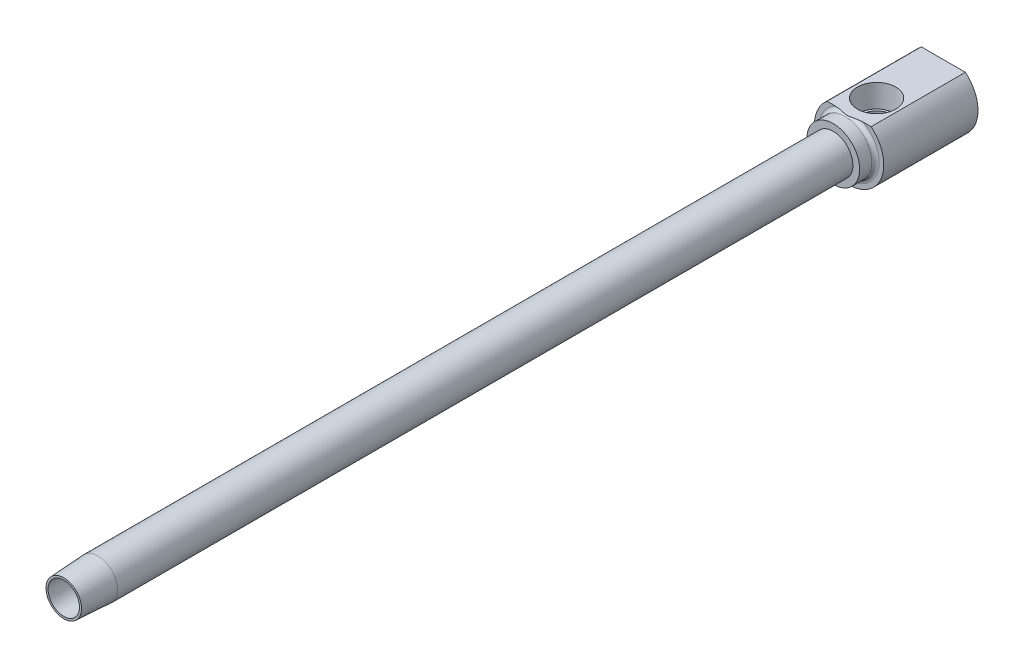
ISO-10303-21;
HEADER;
FILE_DESCRIPTION(('STEP AP214'),'2;1');
FILE_NAME('part.step','',(''),(''),'','','');
FILE_SCHEMA(('AUTOMOTIVE_DESIGN { 1 0 10303 214 1 1 1 1 }'));
ENDSEC;
DATA;
#1=APPLICATION_CONTEXT('core data for automotive mechanical design processes');
#2=APPLICATION_PROTOCOL_DEFINITION('international standard','automotive_design',2000,#1);
#3=PRODUCT_CONTEXT('',#1,'mechanical');
#4=PRODUCT('Part','Part','',(#3));
#5=PRODUCT_RELATED_PRODUCT_CATEGORY('part','',(#4));
#6=PRODUCT_DEFINITION_FORMATION('','',#4);
#7=PRODUCT_DEFINITION_CONTEXT('part definition',#1,'design');
#8=PRODUCT_DEFINITION('design','',#6,#7);
#9=PRODUCT_DEFINITION_SHAPE('','',#8);
#10=(LENGTH_UNIT() NAMED_UNIT(*) SI_UNIT(.MILLI.,.METRE.));
#11=(NAMED_UNIT(*) PLANE_ANGLE_UNIT() SI_UNIT($,.RADIAN.));
#12=(NAMED_UNIT(*) SI_UNIT($,.STERADIAN.) SOLID_ANGLE_UNIT());
#13=UNCERTAINTY_MEASURE_WITH_UNIT(LENGTH_MEASURE(1.E-05),#10,'distance_accuracy_value','');
#14=(GEOMETRIC_REPRESENTATION_CONTEXT(3) GLOBAL_UNCERTAINTY_ASSIGNED_CONTEXT((#13)) GLOBAL_UNIT_ASSIGNED_CONTEXT((#10,
#11,#12)) REPRESENTATION_CONTEXT('',''));
#15=CARTESIAN_POINT('',(0.,0.,0.));
#16=DIRECTION('',(0.,0.,1.));
#17=DIRECTION('',(1.,0.,0.));
#18=AXIS2_PLACEMENT_3D('',#15,#16,#17);
#19=CARTESIAN_POINT('',(0.,0.,-223.634766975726));
#20=DIRECTION('',(0.,0.,-1.));
#21=DIRECTION('',(-1.,0.,0.));
#22=AXIS2_PLACEMENT_3D('',#19,#20,#21);
#23=CYLINDRICAL_SURFACE('',#22,3.9751);
#24=CARTESIAN_POINT('',(0.,0.,-6.8834));
#25=DIRECTION('',(0.,0.,-1.));
#26=DIRECTION('',(-1.,0.,0.));
#27=AXIS2_PLACEMENT_3D('',#24,#25,#26);
#28=CIRCLE('',#27,3.9751);
#29=CARTESIAN_POINT('',(-3.9751,0.,-6.8834));
#30=VERTEX_POINT('',#29);
#31=EDGE_CURVE('E230',#30,#30,#28,.T.);
#32=ORIENTED_EDGE('',*,*,#31,.T.);
#33=EDGE_LOOP('',(#32));
#34=FACE_BOUND('',#33,.T.);
#35=CARTESIAN_POINT('',(0.,0.,-155.5496));
#36=DIRECTION('',(0.,0.,-1.));
#37=DIRECTION('',(-1.,0.,0.));
#38=AXIS2_PLACEMENT_3D('',#35,#36,#37);
#39=CIRCLE('',#38,3.9751);
#40=CARTESIAN_POINT('',(-3.9751,0.,-155.5496));
#41=VERTEX_POINT('',#40);
#42=EDGE_CURVE('E190',#41,#41,#39,.T.);
#43=ORIENTED_EDGE('',*,*,#42,.F.);
#44=EDGE_LOOP('',(#43));
#45=FACE_BOUND('',#44,.T.);
#46=ADVANCED_FACE('F15',(#34,#45),#23,.T.);
#47=CARTESIAN_POINT('',(-3.175,0.,-155.5496));
#48=DIRECTION('',(0.,0.,1.));
#49=DIRECTION('',(1.,0.,0.));
#50=AXIS2_PLACEMENT_3D('',#47,#48,#49);
#51=PLANE('',#50);
#52=CARTESIAN_POINT('',(0.,0.,-155.5496));
#53=DIRECTION('',(0.,0.,-1.));
#54=DIRECTION('',(-1.,0.,0.));
#55=AXIS2_PLACEMENT_3D('',#52,#53,#54);
#56=CIRCLE('',#55,3.175);
#57=CARTESIAN_POINT('',(-3.175,0.,-155.5496));
#58=VERTEX_POINT('',#57);
#59=EDGE_CURVE('E234',#58,#58,#56,.T.);
#60=ORIENTED_EDGE('',*,*,#59,.F.);
#61=EDGE_LOOP('',(#60));
#62=FACE_BOUND('',#61,.T.);
#63=CARTESIAN_POINT('',(0.,-0.206790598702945,-155.5496));
#64=DIRECTION('',(0.,0.,1.));
#65=DIRECTION('',(0.,1.,0.));
#66=AXIS2_PLACEMENT_3D('',#63,#64,#65);
#67=ELLIPSE('',#66,2.91070678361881,2.77750646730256);
#68=CARTESIAN_POINT('',(0.,2.70391618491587,-155.5496));
#69=VERTEX_POINT('',#68);
#70=EDGE_CURVE('E192',#69,#69,#67,.F.);
#71=ORIENTED_EDGE('',*,*,#70,.T.);
#72=EDGE_LOOP('',(#71));
#73=FACE_BOUND('',#72,.T.);
#74=ADVANCED_FACE('F211',(#62,#73),#51,.T.);
#75=CARTESIAN_POINT('',(-3.9751,0.,-155.5496));
#76=DIRECTION('',(0.,0.,1.));
#77=DIRECTION('',(1.,0.,0.));
#78=AXIS2_PLACEMENT_3D('',#75,#76,#77);
#79=PLANE('',#78);
#80=ORIENTED_EDGE('',*,*,#42,.T.);
#81=EDGE_LOOP('',(#80));
#82=FACE_BOUND('',#81,.T.);
#83=CARTESIAN_POINT('',(0.,0.,-155.5496));
#84=DIRECTION('',(0.,0.,-1.));
#85=DIRECTION('',(-1.,0.,0.));
#86=AXIS2_PLACEMENT_3D('',#83,#84,#85);
#87=CIRCLE('',#86,5.334);
#88=CARTESIAN_POINT('',(-5.334,0.,-155.5496));
#89=VERTEX_POINT('',#88);
#90=EDGE_CURVE('E252',#89,#89,#87,.T.);
#91=ORIENTED_EDGE('',*,*,#90,.F.);
#92=EDGE_LOOP('',(#91));
#93=FACE_BOUND('',#92,.T.);
#94=ADVANCED_FACE('F214',(#82,#93),#79,.T.);
#95=CARTESIAN_POINT('',(-3.175,0.,0.));
#96=DIRECTION('',(0.,0.,1.));
#97=DIRECTION('',(1.,0.,0.));
#98=AXIS2_PLACEMENT_3D('',#95,#96,#97);
#99=PLANE('',#98);
#100=CARTESIAN_POINT('',(0.,0.,0.));
#101=DIRECTION('',(0.,0.,-1.));
#102=DIRECTION('',(-1.,0.,0.));
#103=AXIS2_PLACEMENT_3D('',#100,#101,#102);
#104=CIRCLE('',#103,3.5941);
#105=CARTESIAN_POINT('',(-3.5941,0.,0.));
#106=VERTEX_POINT('',#105);
#107=EDGE_CURVE('E508',#106,#106,#104,.T.);
#108=ORIENTED_EDGE('',*,*,#107,.F.);
#109=EDGE_LOOP('',(#108));
#110=FACE_BOUND('',#109,.T.);
#111=CARTESIAN_POINT('',(0.,0.,0.));
#112=DIRECTION('',(0.,0.,-1.));
#113=DIRECTION('',(-1.,0.,0.));
#114=AXIS2_PLACEMENT_3D('',#111,#112,#113);
#115=CIRCLE('',#114,3.175);
#116=CARTESIAN_POINT('',(-3.175,0.,0.));
#117=VERTEX_POINT('',#116);
#118=EDGE_CURVE('E19',#117,#117,#115,.T.);
#119=ORIENTED_EDGE('',*,*,#118,.T.);
#120=EDGE_LOOP('',(#119));
#121=FACE_BOUND('',#120,.T.);
#122=ADVANCED_FACE('F17',(#110,#121),#99,.T.);
#123=CARTESIAN_POINT('',(0.,0.,-223.634766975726));
#124=DIRECTION('',(0.,0.,-1.));
#125=DIRECTION('',(-1.,0.,0.));
#126=AXIS2_PLACEMENT_3D('',#123,#124,#125);
#127=CYLINDRICAL_SURFACE('',#126,3.175);
#128=ORIENTED_EDGE('',*,*,#59,.T.);
#129=EDGE_LOOP('',(#128));
#130=FACE_BOUND('',#129,.T.);
#131=ORIENTED_EDGE('',*,*,#118,.F.);
#132=EDGE_LOOP('',(#131));
#133=FACE_BOUND('',#132,.T.);
#134=ADVANCED_FACE('F209',(#130,#133),#127,.F.);
#135=CARTESIAN_POINT('',(-7.0104,0.,-177.8));
#136=DIRECTION('',(0.,0.,-1.));
#137=DIRECTION('',(-1.,0.,0.));
#138=AXIS2_PLACEMENT_3D('',#135,#136,#137);
#139=PLANE('',#138);
#140=DIRECTION('',(1.,0.,0.));
#141=VECTOR('',#140,1.);
#142=CARTESIAN_POINT('',(-1.83308710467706,3.175,-177.8));
#143=LINE('',#142,#141);
#144=CARTESIAN_POINT('',(-1.83308710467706,3.175,-177.8));
#145=VERTEX_POINT('',#144);
#146=CARTESIAN_POINT('',(1.83308710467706,3.175,-177.8));
#147=VERTEX_POINT('',#146);
#148=EDGE_CURVE('E37',#145,#147,#143,.T.);
#149=ORIENTED_EDGE('',*,*,#148,.F.);
#150=DIRECTION('',(0.5,0.866025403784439,0.));
#151=VECTOR('',#150,1.);
#152=CARTESIAN_POINT('',(-3.66617420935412,0.,-177.8));
#153=LINE('',#152,#151);
#154=CARTESIAN_POINT('',(-3.66617420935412,0.,-177.8));
#155=VERTEX_POINT('',#154);
#156=EDGE_CURVE('E278',#155,#145,#153,.T.);
#157=ORIENTED_EDGE('',*,*,#156,.F.);
#158=DIRECTION('',(-0.5,0.866025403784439,0.));
#159=VECTOR('',#158,1.);
#160=CARTESIAN_POINT('',(-1.83308710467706,-3.175,-177.8));
#161=LINE('',#160,#159);
#162=CARTESIAN_POINT('',(-1.83308710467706,-3.175,-177.8));
#163=VERTEX_POINT('',#162);
#164=EDGE_CURVE('E282',#163,#155,#161,.T.);
#165=ORIENTED_EDGE('',*,*,#164,.F.);
#166=DIRECTION('',(-1.,0.,0.));
#167=VECTOR('',#166,1.);
#168=CARTESIAN_POINT('',(1.83308710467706,-3.175,-177.8));
#169=LINE('',#168,#167);
#170=CARTESIAN_POINT('',(1.83308710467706,-3.175,-177.8));
#171=VERTEX_POINT('',#170);
#172=EDGE_CURVE('E285',#171,#163,#169,.T.);
#173=ORIENTED_EDGE('',*,*,#172,.F.);
#174=DIRECTION('',(-0.5,-0.866025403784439,0.));
#175=VECTOR('',#174,1.);
#176=CARTESIAN_POINT('',(3.66617420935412,0.,-177.8));
#177=LINE('',#176,#175);
#178=CARTESIAN_POINT('',(3.66617420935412,0.,-177.8));
#179=VERTEX_POINT('',#178);
#180=EDGE_CURVE('E288',#179,#171,#177,.T.);
#181=ORIENTED_EDGE('',*,*,#180,.F.);
#182=DIRECTION('',(0.5,-0.866025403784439,0.));
#183=VECTOR('',#182,1.);
#184=CARTESIAN_POINT('',(1.83308710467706,3.175,-177.8));
#185=LINE('',#184,#183);
#186=EDGE_CURVE('E291',#147,#179,#185,.T.);
#187=ORIENTED_EDGE('',*,*,#186,.F.);
#188=EDGE_LOOP('',(#149,#157,#165,#173,#181,#187));
#189=FACE_BOUND('',#188,.T.);
#190=DIRECTION('',(-1.,0.,0.));
#191=VECTOR('',#190,1.);
#192=CARTESIAN_POINT('',(-4.4577,5.41060244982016,-177.8));
#193=LINE('',#192,#191);
#194=CARTESIAN_POINT('',(4.4577,5.41060244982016,-177.8));
#195=VERTEX_POINT('',#194);
#196=CARTESIAN_POINT('',(-4.4577,5.41060244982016,-177.8));
#197=VERTEX_POINT('',#196);
#198=EDGE_CURVE('E261',#195,#197,#193,.T.);
#199=ORIENTED_EDGE('',*,*,#198,.F.);
#200=CARTESIAN_POINT('',(0.,0.,-177.8));
#201=DIRECTION('',(0.,0.,-1.));
#202=DIRECTION('',(-1.,0.,0.));
#203=AXIS2_PLACEMENT_3D('',#200,#201,#202);
#204=CIRCLE('',#203,7.0104);
#205=EDGE_CURVE('E238',#195,#197,#204,.T.);
#206=ORIENTED_EDGE('',*,*,#205,.T.);
#207=EDGE_LOOP('',(#199,#206));
#208=FACE_BOUND('',#207,.T.);
#209=ADVANCED_FACE('F205',(#189,#208),#139,.T.);
#210=CARTESIAN_POINT('',(0.,0.,-223.634766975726));
#211=DIRECTION('',(0.,0.,-1.));
#212=DIRECTION('',(-1.,0.,0.));
#213=AXIS2_PLACEMENT_3D('',#210,#211,#212);
#214=CYLINDRICAL_SURFACE('',#213,7.0104);
#215=DIRECTION('',(0.,0.,-1.));
#216=VECTOR('',#215,1.);
#217=CARTESIAN_POINT('',(-4.4577,5.41060244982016,-148.4376));
#218=LINE('',#217,#216);
#219=CARTESIAN_POINT('',(-4.4577,5.41060244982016,-158.75));
#220=VERTEX_POINT('',#219);
#221=EDGE_CURVE('E258',#220,#197,#218,.T.);
#222=ORIENTED_EDGE('',*,*,#221,.T.);
#223=ORIENTED_EDGE('',*,*,#205,.F.);
#224=DIRECTION('',(0.,0.,-1.));
#225=VECTOR('',#224,1.);
#226=CARTESIAN_POINT('',(4.4577,5.41060244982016,-148.4376));
#227=LINE('',#226,#225);
#228=CARTESIAN_POINT('',(4.4577,5.41060244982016,-158.75));
#229=VERTEX_POINT('',#228);
#230=EDGE_CURVE('E259',#229,#195,#227,.T.);
#231=ORIENTED_EDGE('',*,*,#230,.F.);
#232=CARTESIAN_POINT('',(0.,0.,-158.75));
#233=DIRECTION('',(0.,0.,-1.));
#234=DIRECTION('',(-1.,0.,0.));
#235=AXIS2_PLACEMENT_3D('',#232,#233,#234);
#236=CIRCLE('',#235,7.0104);
#237=EDGE_CURVE('E241',#229,#220,#236,.T.);
#238=ORIENTED_EDGE('',*,*,#237,.T.);
#239=EDGE_LOOP('',(#222,#223,#231,#238));
#240=FACE_BOUND('',#239,.T.);
#241=ADVANCED_FACE('F201',(#240),#214,.T.);
#242=CARTESIAN_POINT('',(-6.096,0.,-158.75));
#243=DIRECTION('',(0.,0.,1.));
#244=DIRECTION('',(1.,0.,0.));
#245=AXIS2_PLACEMENT_3D('',#242,#243,#244);
#246=PLANE('',#245);
#247=DIRECTION('',(1.,0.,0.));
#248=VECTOR('',#247,1.);
#249=CARTESIAN_POINT('',(-6.096,5.41060244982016,-158.75));
#250=LINE('',#249,#248);
#251=CARTESIAN_POINT('',(-2.80830858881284,5.41060244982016,-158.75));
#252=VERTEX_POINT('',#251);
#253=EDGE_CURVE('E255',#220,#252,#250,.T.);
#254=ORIENTED_EDGE('',*,*,#253,.F.);
#255=ORIENTED_EDGE('',*,*,#237,.F.);
#256=CARTESIAN_POINT('',(2.80830858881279,5.41060244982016,-158.75));
#257=VERTEX_POINT('',#256);
#258=EDGE_CURVE('E256',#257,#229,#250,.T.);
#259=ORIENTED_EDGE('',*,*,#258,.F.);
#260=CARTESIAN_POINT('',(0.,0.,-158.75));
#261=DIRECTION('',(0.,0.,-1.));
#262=DIRECTION('',(-1.,0.,0.));
#263=AXIS2_PLACEMENT_3D('',#260,#261,#262);
#264=CIRCLE('',#263,6.096);
#265=EDGE_CURVE('E246',#257,#252,#264,.T.);
#266=ORIENTED_EDGE('',*,*,#265,.T.);
#267=EDGE_LOOP('',(#254,#255,#259,#266));
#268=FACE_BOUND('',#267,.T.);
#269=ADVANCED_FACE('F197',(#268),#246,.T.);
#270=CARTESIAN_POINT('',(0.,0.,-157.988));
#271=DIRECTION('',(0.,0.,-1.));
#272=DIRECTION('',(-1.,0.,0.));
#273=AXIS2_PLACEMENT_3D('',#270,#271,#272);
#274=TOROIDAL_SURFACE('',#273,6.096,0.762);
#275=CARTESIAN_POINT('',(0.,5.41060244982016,-158.320977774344));
#276=CARTESIAN_POINT('',(0.0521470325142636,5.41060244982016,-158.320966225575));
#277=CARTESIAN_POINT('',(0.104287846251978,5.41060244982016,-158.322542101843));
#278=CARTESIAN_POINT('',(0.208401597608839,5.41060244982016,-158.328631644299));
#279=CARTESIAN_POINT('',(0.260374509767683,5.41060244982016,-158.333145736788));
#280=CARTESIAN_POINT('',(0.416241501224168,5.41060244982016,-158.350448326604));
#281=CARTESIAN_POINT('',(0.519704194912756,5.41060244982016,-158.366991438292));
#282=CARTESIAN_POINT('',(0.726918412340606,5.41060244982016,-158.405619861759));
#283=CARTESIAN_POINT('',(0.830655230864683,5.41060244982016,-158.427776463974));
#284=CARTESIAN_POINT('',(1.03759009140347,5.41060244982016,-158.473840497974));
#285=CARTESIAN_POINT('',(1.14078865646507,5.41060244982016,-158.497745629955));
#286=CARTESIAN_POINT('',(1.34834228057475,5.41060244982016,-158.545205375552));
#287=CARTESIAN_POINT('',(1.45269869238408,5.41060244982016,-158.568754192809));
#288=CARTESIAN_POINT('',(1.66197970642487,5.41060244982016,-158.613460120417));
#289=CARTESIAN_POINT('',(1.76690452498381,5.41060244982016,-158.634616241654));
#290=CARTESIAN_POINT('',(1.97693672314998,5.41060244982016,-158.672852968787));
#291=CARTESIAN_POINT('',(2.0820400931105,5.41060244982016,-158.689954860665));
#292=CARTESIAN_POINT('',(2.2929864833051,5.41060244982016,-158.718645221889));
#293=CARTESIAN_POINT('',(2.39882937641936,5.41060244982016,-158.730234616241));
#294=CARTESIAN_POINT('',(2.63825679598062,5.41060244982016,-158.748170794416));
#295=CARTESIAN_POINT('',(2.77203238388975,5.41060244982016,-158.752426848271));
#296=CARTESIAN_POINT('',(2.97236053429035,5.41060244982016,-158.74675427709));
#297=CARTESIAN_POINT('',(3.03908464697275,5.41060244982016,-158.74285339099));
#298=CARTESIAN_POINT('',(3.17206397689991,5.41060244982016,-158.730250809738));
#299=CARTESIAN_POINT('',(3.23831943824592,5.41060244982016,-158.721551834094));
#300=CARTESIAN_POINT('',(3.37725624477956,5.41060244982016,-158.69711512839));
#301=CARTESIAN_POINT('',(3.44982215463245,5.41060244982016,-158.68069575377));
#302=CARTESIAN_POINT('',(3.5924596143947,5.41060244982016,-158.639071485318));
#303=CARTESIAN_POINT('',(3.66253326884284,5.41060244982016,-158.613874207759));
#304=CARTESIAN_POINT('',(3.77900159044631,5.41060244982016,-158.561023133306));
#305=CARTESIAN_POINT('',(3.82657256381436,5.41060244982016,-158.535989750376));
#306=CARTESIAN_POINT('',(3.91754959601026,5.41060244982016,-158.479184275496));
#307=CARTESIAN_POINT('',(3.96096325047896,5.41060244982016,-158.447424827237));
#308=CARTESIAN_POINT('',(4.02798010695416,5.41060244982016,-158.38789070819));
#309=CARTESIAN_POINT('',(4.05342428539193,5.41060244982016,-158.362198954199));
#310=CARTESIAN_POINT('',(4.10009948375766,5.41060244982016,-158.307215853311));
#311=CARTESIAN_POINT('',(4.12133630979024,5.41060244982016,-158.277929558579));
#312=CARTESIAN_POINT('',(4.15466127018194,5.41060244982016,-158.22188761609));
#313=CARTESIAN_POINT('',(4.1677217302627,5.41060244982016,-158.195714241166));
#314=CARTESIAN_POINT('',(4.18933719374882,5.41060244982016,-158.141556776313));
#315=CARTESIAN_POINT('',(4.19789541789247,5.41060244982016,-158.113573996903));
#316=CARTESIAN_POINT('',(4.20987180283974,5.41060244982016,-158.056334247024));
#317=CARTESIAN_POINT('',(4.21325884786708,5.41060244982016,-158.027070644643));
#318=CARTESIAN_POINT('',(4.21447858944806,5.41060244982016,-157.968428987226));
#319=CARTESIAN_POINT('',(4.2123124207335,5.41060244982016,-157.939050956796));
#320=CARTESIAN_POINT('',(4.20309810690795,5.41060244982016,-157.883964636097));
#321=CARTESIAN_POINT('',(4.19653350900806,5.41060244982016,-157.858172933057));
#322=CARTESIAN_POINT('',(4.17948851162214,5.41060244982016,-157.807930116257));
#323=CARTESIAN_POINT('',(4.16900680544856,5.41060244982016,-157.783479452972));
#324=CARTESIAN_POINT('',(4.14035818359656,5.41060244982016,-157.727852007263));
#325=CARTESIAN_POINT('',(4.1207833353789,5.41060244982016,-157.69740126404));
#326=CARTESIAN_POINT('',(4.07697861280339,5.41060244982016,-157.640060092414));
#327=CARTESIAN_POINT('',(4.05273917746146,5.41060244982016,-157.613177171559));
#328=CARTESIAN_POINT('',(3.98868725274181,5.41060244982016,-157.551156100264));
#329=CARTESIAN_POINT('',(3.94690497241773,5.41060244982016,-157.518064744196));
#330=CARTESIAN_POINT('',(3.85879527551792,5.41060244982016,-157.458693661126));
#331=CARTESIAN_POINT('',(3.81245915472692,5.41060244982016,-157.432427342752));
#332=CARTESIAN_POINT('',(3.72452671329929,5.41060244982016,-157.389445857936));
#333=CARTESIAN_POINT('',(3.68333828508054,5.41060244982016,-157.371877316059));
#334=CARTESIAN_POINT('',(3.59958587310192,5.41060244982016,-157.340360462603));
#335=CARTESIAN_POINT('',(3.55702092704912,5.41060244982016,-157.326414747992));
#336=CARTESIAN_POINT('',(3.42786902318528,5.41060244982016,-157.289290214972));
#337=CARTESIAN_POINT('',(3.33991210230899,5.41060244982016,-157.270863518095));
#338=CARTESIAN_POINT('',(3.16528158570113,5.41060244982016,-157.244240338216));
#339=CARTESIAN_POINT('',(3.07864723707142,5.41060244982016,-157.235756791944));
#340=CARTESIAN_POINT('',(2.90489485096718,5.41060244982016,-157.226131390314));
#341=CARTESIAN_POINT('',(2.8177763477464,5.41060244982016,-157.224998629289));
#342=CARTESIAN_POINT('',(2.64327811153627,5.41060244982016,-157.22865046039));
#343=CARTESIAN_POINT('',(2.55589913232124,5.41060244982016,-157.233463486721));
#344=CARTESIAN_POINT('',(2.38166962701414,5.41060244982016,-157.247864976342));
#345=CARTESIAN_POINT('',(2.29481855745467,5.41060244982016,-157.257447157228));
#346=CARTESIAN_POINT('',(2.01384766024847,5.41060244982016,-157.294670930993));
#347=CARTESIAN_POINT('',(1.82076533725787,5.41060244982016,-157.329945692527));
#348=CARTESIAN_POINT('',(1.53229430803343,5.41060244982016,-157.389884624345));
#349=CARTESIAN_POINT('',(1.43609183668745,5.41060244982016,-157.411096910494));
#350=CARTESIAN_POINT('',(1.24390982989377,5.41060244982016,-157.454534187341));
#351=CARTESIAN_POINT('',(1.14793028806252,5.41060244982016,-157.476759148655));
#352=CARTESIAN_POINT('',(0.957697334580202,5.41060244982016,-157.520093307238));
#353=CARTESIAN_POINT('',(0.863446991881,5.41060244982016,-157.541215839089));
#354=CARTESIAN_POINT('',(0.674290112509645,5.41060244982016,-157.580544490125));
#355=CARTESIAN_POINT('',(0.57938341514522,5.41060244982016,-157.598749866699));
#356=CARTESIAN_POINT('',(0.389272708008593,5.41060244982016,-157.628753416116));
#357=CARTESIAN_POINT('',(0.294077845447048,5.41060244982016,-157.640603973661));
#358=CARTESIAN_POINT('',(0.150791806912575,5.41060244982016,-157.651139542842));
#359=CARTESIAN_POINT('',(0.102969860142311,5.41060244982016,-157.653445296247));
#360=CARTESIAN_POINT('',(0.00727423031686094,5.41060244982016,-157.6554444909));
#361=CARTESIAN_POINT('',(-0.0405994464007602,5.41060244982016,-157.655138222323));
#362=CARTESIAN_POINT('',(-0.136934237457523,5.41060244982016,-157.651917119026));
#363=CARTESIAN_POINT('',(-0.18539408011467,5.41060244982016,-157.648965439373));
#364=CARTESIAN_POINT('',(-0.282118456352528,5.41060244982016,-157.640689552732));
#365=CARTESIAN_POINT('',(-0.330382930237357,5.41060244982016,-157.635364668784));
#366=CARTESIAN_POINT('',(-0.475151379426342,5.41060244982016,-157.616449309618));
#367=CARTESIAN_POINT('',(-0.571263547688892,5.41060244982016,-157.599936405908));
#368=CARTESIAN_POINT('',(-0.764047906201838,5.41060244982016,-157.562565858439));
#369=CARTESIAN_POINT('',(-0.860707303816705,5.41060244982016,-157.541647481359));
#370=CARTESIAN_POINT('',(-1.05357295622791,5.41060244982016,-157.498459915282));
#371=CARTESIAN_POINT('',(-1.1497796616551,5.41060244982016,-157.476192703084));
#372=CARTESIAN_POINT('',(-1.36433899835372,5.41060244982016,-157.427144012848));
#373=CARTESIAN_POINT('',(-1.48272280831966,5.41060244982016,-157.400495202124));
#374=CARTESIAN_POINT('',(-1.72029970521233,5.41060244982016,-157.350573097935));
#375=CARTESIAN_POINT('',(-1.83949323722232,5.41060244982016,-157.327301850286));
#376=CARTESIAN_POINT('',(-2.07789765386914,5.41060244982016,-157.286591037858));
#377=CARTESIAN_POINT('',(-2.1971003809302,5.41060244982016,-157.269105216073));
#378=CARTESIAN_POINT('',(-2.43636519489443,5.41060244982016,-157.242063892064));
#379=CARTESIAN_POINT('',(-2.5564264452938,5.41060244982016,-157.232501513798));
#380=CARTESIAN_POINT('',(-2.76780194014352,5.41060244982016,-157.22516409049));
#381=CARTESIAN_POINT('',(-2.85902659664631,5.41060244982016,-157.225092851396));
#382=CARTESIAN_POINT('',(-3.04144991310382,5.41060244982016,-157.232751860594));
#383=CARTESIAN_POINT('',(-3.13264774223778,5.41060244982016,-157.240504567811));
#384=CARTESIAN_POINT('',(-3.31458996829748,5.41060244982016,-157.266086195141));
#385=CARTESIAN_POINT('',(-3.40532344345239,5.41060244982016,-157.284002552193));
#386=CARTESIAN_POINT('',(-3.53857286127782,5.41060244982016,-157.320698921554));
#387=CARTESIAN_POINT('',(-3.58245316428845,5.41060244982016,-157.334541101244));
#388=CARTESIAN_POINT('',(-3.66883050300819,5.41060244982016,-157.365985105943));
#389=CARTESIAN_POINT('',(-3.71132868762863,5.41060244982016,-157.383583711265));
#390=CARTESIAN_POINT('',(-3.7923438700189,5.41060244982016,-157.422178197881));
#391=CARTESIAN_POINT('',(-3.83095410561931,5.41060244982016,-157.442975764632));
#392=CARTESIAN_POINT('',(-3.9054933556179,5.41060244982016,-157.489081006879));
#393=CARTESIAN_POINT('',(-3.94141935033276,5.41060244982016,-157.514393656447));
#394=CARTESIAN_POINT('',(-4.00964525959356,5.41060244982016,-157.570392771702));
#395=CARTESIAN_POINT('',(-4.04189445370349,5.41060244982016,-157.601142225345));
#396=CARTESIAN_POINT('',(-4.10014383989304,5.41060244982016,-157.668084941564));
#397=CARTESIAN_POINT('',(-4.12616464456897,5.41060244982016,-157.704259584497));
#398=CARTESIAN_POINT('',(-4.16162371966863,5.41060244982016,-157.767760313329));
#399=CARTESIAN_POINT('',(-4.17366550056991,5.41060244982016,-157.793633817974));
#400=CARTESIAN_POINT('',(-4.19334521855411,5.41060244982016,-157.847014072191));
#401=CARTESIAN_POINT('',(-4.20098675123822,5.41060244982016,-157.874519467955));
#402=CARTESIAN_POINT('',(-4.21130602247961,5.41060244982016,-157.93060948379));
#403=CARTESIAN_POINT('',(-4.21395773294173,5.41060244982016,-157.959198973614));
#404=CARTESIAN_POINT('',(-4.21398264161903,5.41060244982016,-158.016380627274));
#405=CARTESIAN_POINT('',(-4.21135613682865,5.41060244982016,-158.044972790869));
#406=CARTESIAN_POINT('',(-4.2014381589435,5.41060244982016,-158.099159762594));
#407=CARTESIAN_POINT('',(-4.19450087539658,5.41060244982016,-158.124821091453));
#408=CARTESIAN_POINT('',(-4.1767694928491,5.41060244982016,-158.174761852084));
#409=CARTESIAN_POINT('',(-4.16597399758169,5.41060244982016,-158.199040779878));
#410=CARTESIAN_POINT('',(-4.13643456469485,5.41060244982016,-158.254664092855));
#411=CARTESIAN_POINT('',(-4.11622825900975,5.41060244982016,-158.28523117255));
#412=CARTESIAN_POINT('',(-4.07115731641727,5.41060244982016,-158.342709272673));
#413=CARTESIAN_POINT('',(-4.04628281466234,5.41060244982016,-158.369612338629));
#414=CARTESIAN_POINT('',(-3.98047143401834,5.41060244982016,-158.431796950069));
#415=CARTESIAN_POINT('',(-3.93753463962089,5.41060244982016,-158.464948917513));
#416=CARTESIAN_POINT('',(-3.84713170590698,5.41060244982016,-158.524276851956));
#417=CARTESIAN_POINT('',(-3.79965701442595,5.41060244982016,-158.550439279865));
#418=CARTESIAN_POINT('',(-3.7094552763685,5.41060244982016,-158.593219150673));
#419=CARTESIAN_POINT('',(-3.66712202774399,5.41060244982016,-158.610685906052));
#420=CARTESIAN_POINT('',(-3.5810935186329,5.41060244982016,-158.641903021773));
#421=CARTESIAN_POINT('',(-3.53739729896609,5.41060244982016,-158.655650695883));
#422=CARTESIAN_POINT('',(-3.40486938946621,5.41060244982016,-158.692069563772));
#423=CARTESIAN_POINT('',(-3.31469658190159,5.41060244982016,-158.709873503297));
#424=CARTESIAN_POINT('',(-3.13512177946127,5.41060244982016,-158.735172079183));
#425=CARTESIAN_POINT('',(-3.04574747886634,5.41060244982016,-158.742887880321));
#426=CARTESIAN_POINT('',(-2.86659161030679,5.41060244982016,-158.750757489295));
#427=CARTESIAN_POINT('',(-2.77680968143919,5.41060244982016,-158.750902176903));
#428=CARTESIAN_POINT('',(-2.59707026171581,5.41060244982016,-158.745129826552));
#429=CARTESIAN_POINT('',(-2.50711380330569,5.41060244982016,-158.739185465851));
#430=CARTESIAN_POINT('',(-2.32777785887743,5.41060244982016,-158.722449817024));
#431=CARTESIAN_POINT('',(-2.2383978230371,5.41060244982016,-158.711664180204));
#432=CARTESIAN_POINT('',(-1.96748151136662,5.41060244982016,-158.67309869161));
#433=CARTESIAN_POINT('',(-1.78682109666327,5.41060244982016,-158.639313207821));
#434=CARTESIAN_POINT('',(-1.51682052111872,5.41060244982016,-158.58271359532));
#435=CARTESIAN_POINT('',(-1.42679945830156,5.41060244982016,-158.56281263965));
#436=CARTESIAN_POINT('',(-1.24695389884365,5.41060244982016,-158.522143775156));
#437=CARTESIAN_POINT('',(-1.15712938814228,5.41060244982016,-158.501375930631));
#438=CARTESIAN_POINT('',(-0.979057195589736,5.41060244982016,-158.460739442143));
#439=CARTESIAN_POINT('',(-0.890811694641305,5.41060244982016,-158.440861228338));
#440=CARTESIAN_POINT('',(-0.71378093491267,5.41060244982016,-158.403401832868));
#441=CARTESIAN_POINT('',(-0.624995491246,5.41060244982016,-158.385821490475));
#442=CARTESIAN_POINT('',(-0.44720333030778,5.41060244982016,-158.355660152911));
#443=CARTESIAN_POINT('',(-0.358203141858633,5.41060244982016,-158.343043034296));
#444=CARTESIAN_POINT('',(-0.179461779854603,5.41060244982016,-158.325716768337));
#445=CARTESIAN_POINT('',(-0.0897216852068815,5.41060244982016,-158.320997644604));
#446=CARTESIAN_POINT('',(0.,5.41060244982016,-158.320977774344));
#447=B_SPLINE_CURVE_WITH_KNOTS('',3,(#275,#276,#277,#278,#279,#280,#281,#282,#283,#284,#285,
#286,#287,#288,#289,#290,#291,#292,#293,#294,#295,#296,#297,#298,#299,#300,#301,#302,#303,#304,
#305,#306,#307,#308,#309,#310,#311,#312,#313,#314,#315,#316,#317,#318,#319,#320,#321,#322,#323,
#324,#325,#326,#327,#328,#329,#330,#331,#332,#333,#334,#335,#336,#337,#338,#339,#340,#341,#342,
#343,#344,#345,#346,#347,#348,#349,#350,#351,#352,#353,#354,#355,#356,#357,#358,#359,#360,#361,
#362,#363,#364,#365,#366,#367,#368,#369,#370,#371,#372,#373,#374,#375,#376,#377,#378,#379,#380,
#381,#382,#383,#384,#385,#386,#387,#388,#389,#390,#391,#392,#393,#394,#395,#396,#397,#398,#399,
#400,#401,#402,#403,#404,#405,#406,#407,#408,#409,#410,#411,#412,#413,#414,#415,#416,#417,#418,
#419,#420,#421,#422,#423,#424,#425,#426,#427,#428,#429,#430,#431,#432,#433,#434,#435,#436,#437,
#438,#439,#440,#441,#442,#443,#444,#445,#446),.UNSPECIFIED.,.T.,.F.,(4,2,2,2,2,2,2,2,2,2,2,2,2,
2,2,2,2,2,2,2,2,2,2,2,2,2,2,2,2,2,2,2,2,2,2,2,2,2,2,2,2,2,2,2,2,2,2,2,2,2,2,2,2,2,2,2,2,2,2,2,2,
2,2,2,2,2,2,2,2,2,2,2,2,2,2,2,2,2,2,2,2,2,2,2,2,4),(0.,0.156408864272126,0.312840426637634,
0.626836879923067,0.945040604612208,1.26283307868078,1.58376524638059,1.90482960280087,
2.22416896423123,2.54345472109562,2.9441659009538,3.14454518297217,3.3448110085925,
3.56760205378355,3.79020027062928,3.95104939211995,4.1115987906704,4.21974493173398,
4.32774077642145,4.41514397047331,4.50248455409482,4.59034863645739,4.67819476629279,
4.75769203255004,4.83721584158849,4.94521135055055,5.05343062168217,5.21243854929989,
5.37175654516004,5.50590155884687,5.64014246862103,5.90890810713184,6.16970670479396,
6.43082789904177,6.69320268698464,6.95523275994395,7.54340798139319,7.83896772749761,
8.13451890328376,8.42427298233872,8.71410070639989,9.00150106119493,9.14506775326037,
9.2886184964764,9.43420020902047,9.57982347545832,9.87216797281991,10.1688428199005,
10.4650929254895,10.8291174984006,11.193361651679,11.5546188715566,11.9155622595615,
12.1889721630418,12.4631691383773,12.7397615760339,12.8776619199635,13.0154445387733,
13.1467577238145,13.2782164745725,13.411312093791,13.5439609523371,13.6292456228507,
13.7144605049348,13.8001186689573,13.8857720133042,13.965178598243,14.0446139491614,
14.1539273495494,14.2634744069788,14.4253063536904,14.5874495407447,14.7246386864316,
14.8619266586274,15.1368206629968,15.4055810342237,15.6746651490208,15.9449620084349,
16.2149441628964,16.7658370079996,17.0424344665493,17.319011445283,17.5903768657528,
17.8618411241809,18.131291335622,18.4004009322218),.UNSPECIFIED.);
#448=EDGE_CURVE('E105',#252,#257,#447,.T.);
#449=ORIENTED_EDGE('',*,*,#448,.F.);
#450=ORIENTED_EDGE('',*,*,#265,.F.);
#451=EDGE_LOOP('',(#449,#450));
#452=FACE_BOUND('',#451,.T.);
#453=CARTESIAN_POINT('',(0.,0.,-157.988));
#454=DIRECTION('',(0.,0.,-1.));
#455=DIRECTION('',(-1.,0.,0.));
#456=AXIS2_PLACEMENT_3D('',#453,#454,#455);
#457=CIRCLE('',#456,5.334);
#458=CARTESIAN_POINT('',(-5.334,0.,-157.988));
#459=VERTEX_POINT('',#458);
#460=EDGE_CURVE('E249',#459,#459,#457,.T.);
#461=ORIENTED_EDGE('',*,*,#460,.T.);
#462=EDGE_LOOP('',(#461));
#463=FACE_BOUND('',#462,.T.);
#464=ADVANCED_FACE('F193',(#452,#463),#274,.F.);
#465=CARTESIAN_POINT('',(0.,0.,-223.634766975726));
#466=DIRECTION('',(0.,0.,-1.));
#467=DIRECTION('',(-1.,0.,0.));
#468=AXIS2_PLACEMENT_3D('',#465,#466,#467);
#469=CYLINDRICAL_SURFACE('',#468,5.334);
#470=ORIENTED_EDGE('',*,*,#90,.T.);
#471=EDGE_LOOP('',(#470));
#472=FACE_BOUND('',#471,.T.);
#473=ORIENTED_EDGE('',*,*,#460,.F.);
#474=EDGE_LOOP('',(#473));
#475=FACE_BOUND('',#474,.T.);
#476=ADVANCED_FACE('F183',(#472,#475),#469,.T.);
#477=CARTESIAN_POINT('',(-4.4577,5.41060244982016,-148.4376));
#478=DIRECTION('',(0.,-1.,0.));
#479=DIRECTION('',(0.,0.,-1.));
#480=AXIS2_PLACEMENT_3D('',#477,#478,#479);
#481=PLANE('',#480);
#482=CARTESIAN_POINT('',(0.,5.41060244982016,-164.3126));
#483=DIRECTION('',(0.,-1.,0.));
#484=DIRECTION('',(0.,0.,-1.));
#485=AXIS2_PLACEMENT_3D('',#482,#483,#484);
#486=CIRCLE('',#485,3.8800785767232);
#487=CARTESIAN_POINT('',(0.,5.41060244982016,-168.192678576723));
#488=VERTEX_POINT('',#487);
#489=EDGE_CURVE('E510',#488,#488,#486,.T.);
#490=ORIENTED_EDGE('',*,*,#489,.T.);
#491=EDGE_LOOP('',(#490));
#492=FACE_BOUND('',#491,.T.);
#493=ORIENTED_EDGE('',*,*,#253,.T.);
#494=ORIENTED_EDGE('',*,*,#448,.T.);
#495=ORIENTED_EDGE('',*,*,#258,.T.);
#496=ORIENTED_EDGE('',*,*,#230,.T.);
#497=ORIENTED_EDGE('',*,*,#198,.T.);
#498=ORIENTED_EDGE('',*,*,#221,.F.);
#499=EDGE_LOOP('',(#493,#494,#495,#496,#497,#498));
#500=FACE_BOUND('',#499,.T.);
#501=ADVANCED_FACE('F179',(#492,#500),#481,.F.);
#502=CARTESIAN_POINT('',(-1.83308710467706,3.175,-172.974));
#503=DIRECTION('',(0.,1.,0.));
#504=DIRECTION('',(-1.,0.,0.));
#505=AXIS2_PLACEMENT_3D('',#502,#503,#504);
#506=PLANE('',#505);
#507=ORIENTED_EDGE('',*,*,#148,.T.);
#508=DIRECTION('',(0.,0.,-1.));
#509=VECTOR('',#508,1.);
#510=CARTESIAN_POINT('',(1.83308710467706,3.175,-172.974));
#511=LINE('',#510,#509);
#512=CARTESIAN_POINT('',(1.83308710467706,3.175,-172.974));
#513=VERTEX_POINT('',#512);
#514=EDGE_CURVE('E266',#513,#147,#511,.T.);
#515=ORIENTED_EDGE('',*,*,#514,.F.);
#516=DIRECTION('',(1.,0.,0.));
#517=VECTOR('',#516,1.);
#518=CARTESIAN_POINT('',(-1.83308710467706,3.175,-172.974));
#519=LINE('',#518,#517);
#520=CARTESIAN_POINT('',(-1.83308710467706,3.175,-172.974));
#521=VERTEX_POINT('',#520);
#522=EDGE_CURVE('E281',#521,#513,#519,.T.);
#523=ORIENTED_EDGE('',*,*,#522,.F.);
#524=DIRECTION('',(0.,0.,-1.));
#525=VECTOR('',#524,1.);
#526=CARTESIAN_POINT('',(-1.83308710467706,3.175,-172.974));
#527=LINE('',#526,#525);
#528=EDGE_CURVE('E265',#521,#145,#527,.T.);
#529=ORIENTED_EDGE('',*,*,#528,.T.);
#530=EDGE_LOOP('',(#507,#515,#523,#529));
#531=FACE_BOUND('',#530,.T.);
#532=ADVANCED_FACE('F161',(#531),#506,.F.);
#533=CARTESIAN_POINT('',(-3.66617420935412,0.,-172.974));
#534=DIRECTION('',(-0.866025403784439,0.5,0.));
#535=DIRECTION('',(-0.5,-0.866025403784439,0.));
#536=AXIS2_PLACEMENT_3D('',#533,#534,#535);
#537=PLANE('',#536);
#538=ORIENTED_EDGE('',*,*,#156,.T.);
#539=ORIENTED_EDGE('',*,*,#528,.F.);
#540=DIRECTION('',(0.5,0.866025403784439,0.));
#541=VECTOR('',#540,1.);
#542=CARTESIAN_POINT('',(-3.66617420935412,0.,-172.974));
#543=LINE('',#542,#541);
#544=CARTESIAN_POINT('',(-3.66617420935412,0.,-172.974));
#545=VERTEX_POINT('',#544);
#546=EDGE_CURVE('E269',#545,#521,#543,.T.);
#547=ORIENTED_EDGE('',*,*,#546,.F.);
#548=DIRECTION('',(0.,0.,-1.));
#549=VECTOR('',#548,1.);
#550=CARTESIAN_POINT('',(-3.66617420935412,0.,-172.974));
#551=LINE('',#550,#549);
#552=EDGE_CURVE('E275',#545,#155,#551,.T.);
#553=ORIENTED_EDGE('',*,*,#552,.T.);
#554=EDGE_LOOP('',(#538,#539,#547,#553));
#555=FACE_BOUND('',#554,.T.);
#556=ADVANCED_FACE('F157',(#555),#537,.F.);
#557=CARTESIAN_POINT('',(-1.83308710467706,-3.175,-172.974));
#558=DIRECTION('',(-0.866025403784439,-0.5,0.));
#559=DIRECTION('',(0.5,-0.866025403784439,0.));
#560=AXIS2_PLACEMENT_3D('',#557,#558,#559);
#561=PLANE('',#560);
#562=ORIENTED_EDGE('',*,*,#164,.T.);
#563=ORIENTED_EDGE('',*,*,#552,.F.);
#564=DIRECTION('',(-0.5,0.866025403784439,0.));
#565=VECTOR('',#564,1.);
#566=CARTESIAN_POINT('',(-1.83308710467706,-3.175,-172.974));
#567=LINE('',#566,#565);
#568=CARTESIAN_POINT('',(-1.83308710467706,-3.175,-172.974));
#569=VERTEX_POINT('',#568);
#570=EDGE_CURVE('E297',#569,#545,#567,.T.);
#571=ORIENTED_EDGE('',*,*,#570,.F.);
#572=DIRECTION('',(0.,0.,-1.));
#573=VECTOR('',#572,1.);
#574=CARTESIAN_POINT('',(-1.83308710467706,-3.175,-172.974));
#575=LINE('',#574,#573);
#576=EDGE_CURVE('E273',#569,#163,#575,.T.);
#577=ORIENTED_EDGE('',*,*,#576,.T.);
#578=EDGE_LOOP('',(#562,#563,#571,#577));
#579=FACE_BOUND('',#578,.T.);
#580=ADVANCED_FACE('F160',(#579),#561,.F.);
#581=CARTESIAN_POINT('',(1.83308710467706,-3.175,-172.974));
#582=DIRECTION('',(0.,-1.,0.));
#583=DIRECTION('',(1.,0.,0.));
#584=AXIS2_PLACEMENT_3D('',#581,#582,#583);
#585=PLANE('',#584);
#586=ORIENTED_EDGE('',*,*,#172,.T.);
#587=ORIENTED_EDGE('',*,*,#576,.F.);
#588=DIRECTION('',(-1.,0.,0.));
#589=VECTOR('',#588,1.);
#590=CARTESIAN_POINT('',(1.83308710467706,-3.175,-172.974));
#591=LINE('',#590,#589);
#592=CARTESIAN_POINT('',(1.83308710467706,-3.175,-172.974));
#593=VERTEX_POINT('',#592);
#594=EDGE_CURVE('E300',#593,#569,#591,.T.);
#595=ORIENTED_EDGE('',*,*,#594,.F.);
#596=DIRECTION('',(0.,0.,-1.));
#597=VECTOR('',#596,1.);
#598=CARTESIAN_POINT('',(1.83308710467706,-3.175,-172.974));
#599=LINE('',#598,#597);
#600=EDGE_CURVE('E271',#593,#171,#599,.T.);
#601=ORIENTED_EDGE('',*,*,#600,.T.);
#602=EDGE_LOOP('',(#586,#587,#595,#601));
#603=FACE_BOUND('',#602,.T.);
#604=ADVANCED_FACE('F165',(#603),#585,.F.);
#605=CARTESIAN_POINT('',(3.66617420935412,0.,-172.974));
#606=DIRECTION('',(0.866025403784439,-0.5,0.));
#607=DIRECTION('',(0.5,0.866025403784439,0.));
#608=AXIS2_PLACEMENT_3D('',#605,#606,#607);
#609=PLANE('',#608);
#610=ORIENTED_EDGE('',*,*,#180,.T.);
#611=ORIENTED_EDGE('',*,*,#600,.F.);
#612=DIRECTION('',(-0.5,-0.866025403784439,0.));
#613=VECTOR('',#612,1.);
#614=CARTESIAN_POINT('',(3.66617420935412,0.,-172.974));
#615=LINE('',#614,#613);
#616=CARTESIAN_POINT('',(3.66617420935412,0.,-172.974));
#617=VERTEX_POINT('',#616);
#618=EDGE_CURVE('E303',#617,#593,#615,.T.);
#619=ORIENTED_EDGE('',*,*,#618,.F.);
#620=DIRECTION('',(0.,0.,-1.));
#621=VECTOR('',#620,1.);
#622=CARTESIAN_POINT('',(3.66617420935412,0.,-172.974));
#623=LINE('',#622,#621);
#624=EDGE_CURVE('E268',#617,#179,#623,.T.);
#625=ORIENTED_EDGE('',*,*,#624,.T.);
#626=EDGE_LOOP('',(#610,#611,#619,#625));
#627=FACE_BOUND('',#626,.T.);
#628=ADVANCED_FACE('F169',(#627),#609,.F.);
#629=CARTESIAN_POINT('',(1.83308710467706,3.175,-172.974));
#630=DIRECTION('',(0.866025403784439,0.5,0.));
#631=DIRECTION('',(-0.5,0.866025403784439,0.));
#632=AXIS2_PLACEMENT_3D('',#629,#630,#631);
#633=PLANE('',#632);
#634=ORIENTED_EDGE('',*,*,#186,.T.);
#635=ORIENTED_EDGE('',*,*,#624,.F.);
#636=DIRECTION('',(0.5,-0.866025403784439,0.));
#637=VECTOR('',#636,1.);
#638=CARTESIAN_POINT('',(1.83308710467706,3.175,-172.974));
#639=LINE('',#638,#637);
#640=EDGE_CURVE('E306',#513,#617,#639,.T.);
#641=ORIENTED_EDGE('',*,*,#640,.F.);
#642=ORIENTED_EDGE('',*,*,#514,.T.);
#643=EDGE_LOOP('',(#634,#635,#641,#642));
#644=FACE_BOUND('',#643,.T.);
#645=ADVANCED_FACE('F155',(#644),#633,.F.);
#646=CARTESIAN_POINT('',(0.,0.,-172.974));
#647=DIRECTION('',(0.,0.,-1.));
#648=DIRECTION('',(-1.,0.,0.));
#649=AXIS2_PLACEMENT_3D('',#646,#647,#648);
#650=PLANE('',#649);
#651=ORIENTED_EDGE('',*,*,#522,.T.);
#652=ORIENTED_EDGE('',*,*,#640,.T.);
#653=ORIENTED_EDGE('',*,*,#618,.T.);
#654=ORIENTED_EDGE('',*,*,#594,.T.);
#655=ORIENTED_EDGE('',*,*,#570,.T.);
#656=ORIENTED_EDGE('',*,*,#546,.T.);
#657=EDGE_LOOP('',(#651,#652,#653,#654,#655,#656));
#658=FACE_BOUND('',#657,.T.);
#659=ADVANCED_FACE('F151',(#658),#650,.T.);
#660=CARTESIAN_POINT('',(0.,-2.98624109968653,-164.279055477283));
#661=DIRECTION('',(0.,0.298636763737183,0.954366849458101));
#662=DIRECTION('',(0.,-0.954366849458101,0.298636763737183));
#663=AXIS2_PLACEMENT_3D('',#660,#661,#662);
#664=CONICAL_SURFACE('',#663,2.29646041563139,0.826862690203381);
#665=CARTESIAN_POINT('',(-4.07250877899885,-2.19612830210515,-162.802011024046));
#666=CARTESIAN_POINT('',(-3.9289456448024,-2.29613709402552,-162.913288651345));
#667=CARTESIAN_POINT('',(-3.7849275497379,-2.39583064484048,-163.024277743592));
#668=CARTESIAN_POINT('',(-3.49542612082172,-2.59418522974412,-163.24539975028));
#669=CARTESIAN_POINT('',(-3.34994228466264,-2.69284588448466,-163.355532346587));
#670=CARTESIAN_POINT('',(-3.05718484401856,-2.88857438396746,-163.574485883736));
#671=CARTESIAN_POINT('',(-2.9099129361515,-2.98564356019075,-163.683307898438));
#672=CARTESIAN_POINT('',(-2.61260725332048,-3.17745365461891,-163.89919172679));
#673=CARTESIAN_POINT('',(-2.46257392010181,-3.27219493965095,-164.006253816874));
#674=CARTESIAN_POINT('',(-2.30585388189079,-3.36777676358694,-164.115215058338));
#675=CARTESIAN_POINT('',(-2.30125812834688,-3.37057671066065,-164.118407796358));
#676=CARTESIAN_POINT('',(-2.18325993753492,-3.44238980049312,-164.200317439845));
#677=CARTESIAN_POINT('',(-2.06866761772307,-3.51030800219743,-164.278312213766));
#678=CARTESIAN_POINT('',(-1.8942809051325,-3.60949921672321,-164.393860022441));
#679=CARTESIAN_POINT('',(-1.83573157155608,-3.64211739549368,-164.432137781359));
#680=CARTESIAN_POINT('',(-1.71764576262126,-3.70614874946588,-164.508162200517));
#681=CARTESIAN_POINT('',(-1.65810935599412,-3.73756200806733,-164.545908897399));
#682=CARTESIAN_POINT('',(-1.50902814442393,-3.81348555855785,-164.638797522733));
#683=CARTESIAN_POINT('',(-1.41877996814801,-3.85705520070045,-164.693603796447));
#684=CARTESIAN_POINT('',(-1.28105412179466,-3.91788385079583,-164.775307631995));
#685=CARTESIAN_POINT('',(-1.23473646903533,-3.93741186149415,-164.80246748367));
#686=CARTESIAN_POINT('',(-1.14132702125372,-3.97432114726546,-164.856903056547));
#687=CARTESIAN_POINT('',(-1.09423547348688,-3.99170309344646,-164.884178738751));
#688=CARTESIAN_POINT('',(-0.997307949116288,-4.02406270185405,-164.940699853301));
#689=CARTESIAN_POINT('',(-0.947443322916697,-4.03889834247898,-164.969978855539));
#690=CARTESIAN_POINT('',(-0.847763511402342,-4.06317338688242,-165.030895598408));
#691=CARTESIAN_POINT('',(-0.79794836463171,-4.07262087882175,-165.062529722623));
#692=CARTESIAN_POINT('',(-0.715255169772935,-4.08120879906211,-165.120969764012));
#693=CARTESIAN_POINT('',(-0.681720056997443,-4.08256924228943,-165.146442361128));
#694=CARTESIAN_POINT('',(-0.617985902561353,-4.0796552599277,-165.200845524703));
#695=CARTESIAN_POINT('',(-0.587772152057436,-4.075406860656,-165.229759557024));
#696=CARTESIAN_POINT('',(-0.532214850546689,-4.06142412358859,-165.290743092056));
#697=CARTESIAN_POINT('',(-0.506873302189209,-4.05168753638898,-165.322813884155));
#698=CARTESIAN_POINT('',(-0.46085386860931,-4.02824244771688,-165.388937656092));
#699=CARTESIAN_POINT('',(-0.44020178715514,-4.01451287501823,-165.423000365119));
#700=CARTESIAN_POINT('',(-0.402209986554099,-3.98452453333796,-165.492327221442));
#701=CARTESIAN_POINT('',(-0.384909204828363,-3.96823960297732,-165.527600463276));
#702=CARTESIAN_POINT('',(-0.352569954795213,-3.93424634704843,-165.59851457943));
#703=CARTESIAN_POINT('',(-0.337533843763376,-3.91653656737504,-165.634155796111));
#704=CARTESIAN_POINT('',(-0.294316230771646,-3.8621995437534,-165.741215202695));
#705=CARTESIAN_POINT('',(-0.268029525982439,-3.82436859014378,-165.812760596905));
#706=CARTESIAN_POINT('',(-0.231716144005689,-3.77249148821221,-165.909220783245));
#707=CARTESIAN_POINT('',(-0.222113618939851,-3.75880866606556,-165.934509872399));
#708=CARTESIAN_POINT('',(-0.202474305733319,-3.73140875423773,-165.984894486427));
#709=CARTESIAN_POINT('',(-0.192437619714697,-3.71769167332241,-166.009990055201));
#710=CARTESIAN_POINT('',(-0.168352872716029,-3.68618578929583,-166.067409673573));
#711=CARTESIAN_POINT('',(-0.154009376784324,-3.668419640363,-166.099625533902));
#712=CARTESIAN_POINT('',(-0.127399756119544,-3.6394056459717,-166.152043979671));
#713=CARTESIAN_POINT('',(-0.116086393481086,-3.62799604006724,-166.172605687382));
#714=CARTESIAN_POINT('',(-0.0967960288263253,-3.61145924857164,-166.202349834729));
#715=CARTESIAN_POINT('',(-0.0899630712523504,-3.6060329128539,-166.212100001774));
#716=CARTESIAN_POINT('',(-0.0750884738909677,-3.59558512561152,-166.230856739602));
#717=CARTESIAN_POINT('',(-0.0670533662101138,-3.59056169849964,-166.23986694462));
#718=CARTESIAN_POINT('',(-0.0548991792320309,-3.5844602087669,-166.250803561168));
#719=CARTESIAN_POINT('',(-0.051686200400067,-3.58296263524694,-166.2534871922));
#720=CARTESIAN_POINT('',(-0.0449596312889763,-3.58012842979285,-166.258565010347));
#721=CARTESIAN_POINT('',(-0.0414456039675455,-3.57879203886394,-166.26095876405));
#722=CARTESIAN_POINT('',(-0.0340308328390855,-3.5763394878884,-166.265351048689));
#723=CARTESIAN_POINT('',(-0.0301255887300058,-3.57522647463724,-166.267343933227));
#724=CARTESIAN_POINT('',(-0.0219697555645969,-3.57335995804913,-166.270685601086));
#725=CARTESIAN_POINT('',(-0.0177205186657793,-3.57260512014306,-166.272036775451));
#726=CARTESIAN_POINT('',(-0.0102473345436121,-3.57172497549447,-166.273612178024));
#727=CARTESIAN_POINT('',(-0.00708274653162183,-3.57148067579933,-166.274049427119));
#728=CARTESIAN_POINT('',(-0.000714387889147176,-3.57126182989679,-166.274441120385));
#729=CARTESIAN_POINT('',(0.0024893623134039,-3.57128714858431,-166.274395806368));
#730=CARTESIAN_POINT('',(0.00883226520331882,-3.57160403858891,-166.27382862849));
#731=CARTESIAN_POINT('',(0.0119715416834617,-3.57189503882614,-166.273307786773));
#732=CARTESIAN_POINT('',(0.0181194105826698,-3.57271024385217,-166.271848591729));
#733=CARTESIAN_POINT('',(0.0211278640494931,-3.57323469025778,-166.270909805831));
#734=CARTESIAN_POINT('',(0.0286013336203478,-3.5748160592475,-166.268078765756));
#735=CARTESIAN_POINT('',(0.0329459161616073,-3.5760069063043,-166.265946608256));
#736=CARTESIAN_POINT('',(0.0412158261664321,-3.57869375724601,-166.261134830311));
#737=CARTESIAN_POINT('',(0.045139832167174,-3.58019068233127,-166.258453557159));
#738=CARTESIAN_POINT('',(0.0583057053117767,-3.58579053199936,-166.248420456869));
#739=CARTESIAN_POINT('',(0.0666020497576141,-3.5904070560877,-166.24014455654));
#740=CARTESIAN_POINT('',(0.081875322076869,-3.60012687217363,-166.222705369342));
#741=CARTESIAN_POINT('',(0.0888422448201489,-3.60523345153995,-166.213536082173));
#742=CARTESIAN_POINT('',(0.102190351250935,-3.61591467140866,-166.194339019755));
#743=CARTESIAN_POINT('',(0.108534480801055,-3.62149996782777,-166.184291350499));
#744=CARTESIAN_POINT('',(0.120595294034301,-3.63282028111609,-166.163904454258));
#745=CARTESIAN_POINT('',(0.126311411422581,-3.63855542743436,-166.153564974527));
#746=CARTESIAN_POINT('',(0.142827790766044,-3.65591792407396,-166.122225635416));
#747=CARTESIAN_POINT('',(0.15296632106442,-3.66767616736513,-166.100951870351));
#748=CARTESIAN_POINT('',(0.172289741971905,-3.69132323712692,-166.058041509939));
#749=CARTESIAN_POINT('',(0.181473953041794,-3.70321215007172,-166.036404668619));
#750=CARTESIAN_POINT('',(0.199269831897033,-3.7270022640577,-165.992951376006));
#751=CARTESIAN_POINT('',(0.207882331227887,-3.73890342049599,-165.971135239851));
#752=CARTESIAN_POINT('',(0.229463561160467,-3.7691852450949,-165.915377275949));
#753=CARTESIAN_POINT('',(0.242231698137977,-3.78754086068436,-165.881345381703));
#754=CARTESIAN_POINT('',(0.267799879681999,-3.8239796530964,-165.813117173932));
#755=CARTESIAN_POINT('',(0.280599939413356,-3.84206264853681,-165.778920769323));
#756=CARTESIAN_POINT('',(0.306854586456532,-3.87771318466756,-165.710503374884));
#757=CARTESIAN_POINT('',(0.320309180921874,-3.89528071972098,-165.676282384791));
#758=CARTESIAN_POINT('',(0.348599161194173,-3.92953632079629,-165.60798419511));
#759=CARTESIAN_POINT('',(0.363433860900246,-3.94622481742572,-165.573906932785));
#760=CARTESIAN_POINT('',(0.398407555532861,-3.98114177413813,-165.49980378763));
#761=CARTESIAN_POINT('',(0.419019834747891,-3.99907733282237,-165.459853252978));
#762=CARTESIAN_POINT('',(0.465471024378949,-4.03107989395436,-165.381620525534));
#763=CARTESIAN_POINT('',(0.491277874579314,-4.04516943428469,-165.343329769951));
#764=CARTESIAN_POINT('',(0.545373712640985,-4.06542869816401,-165.275375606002));
#765=CARTESIAN_POINT('',(0.572759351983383,-4.07245088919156,-165.245266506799));
#766=CARTESIAN_POINT('',(0.631629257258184,-4.08093258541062,-165.188408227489));
#767=CARTESIAN_POINT('',(0.663120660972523,-4.0823822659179,-165.161665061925));
#768=CARTESIAN_POINT('',(0.7269686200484,-4.08040036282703,-165.112263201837));
#769=CARTESIAN_POINT('',(0.759244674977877,-4.07715530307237,-165.089486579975));
#770=CARTESIAN_POINT('',(0.824583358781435,-4.06724495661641,-165.045838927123));
#771=CARTESIAN_POINT('',(0.857647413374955,-4.06057293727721,-165.024971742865));
#772=CARTESIAN_POINT('',(0.957502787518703,-4.0367873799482,-164.963626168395));
#773=CARTESIAN_POINT('',(1.02438068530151,-4.01595713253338,-164.924796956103));
#774=CARTESIAN_POINT('',(1.14424359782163,-3.97341603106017,-164.855192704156));
#775=CARTESIAN_POINT('',(1.19748827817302,-3.95259799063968,-164.824269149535));
#776=CARTESIAN_POINT('',(1.30297042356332,-3.90857902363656,-164.762382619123));
#777=CARTESIAN_POINT('',(1.35520787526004,-3.88537806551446,-164.731419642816));
#778=CARTESIAN_POINT('',(1.45878040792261,-3.83727954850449,-164.669144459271));
#779=CARTESIAN_POINT('',(1.51011420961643,-3.81237979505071,-164.637831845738));
#780=CARTESIAN_POINT('',(1.61192451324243,-3.76133809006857,-164.574823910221));
#781=CARTESIAN_POINT('',(1.6624009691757,-3.73519607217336,-164.54312856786));
#782=CARTESIAN_POINT('',(1.81237855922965,-3.65554268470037,-164.447667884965));
#783=CARTESIAN_POINT('',(1.91076959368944,-3.60064013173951,-164.383321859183));
#784=CARTESIAN_POINT('',(2.10527415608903,-3.48854629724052,-164.253354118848));
#785=CARTESIAN_POINT('',(2.20138879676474,-3.4313561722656,-164.187733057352));
#786=CARTESIAN_POINT('',(2.30778939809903,-3.36660187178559,-164.113874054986));
#787=CARTESIAN_POINT('',(2.31890687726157,-3.35981809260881,-164.10614176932));
#788=CARTESIAN_POINT('',(2.34111888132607,-3.34622989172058,-164.090663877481));
#789=CARTESIAN_POINT('',(2.35221340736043,-3.3394254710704,-164.082918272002));
#790=CARTESIAN_POINT('',(2.36329704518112,-3.33261086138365,-164.075165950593));
#791=B_SPLINE_CURVE_WITH_KNOTS('',3,(#665,#666,#667,#668,#669,#670,#671,#672,#673,#674,#675,
#676,#677,#678,#679,#680,#681,#682,#683,#684,#685,#686,#687,#688,#689,#690,#691,#692,#693,#694,
#695,#696,#697,#698,#699,#700,#701,#702,#703,#704,#705,#706,#707,#708,#709,#710,#711,#712,#713,
#714,#715,#716,#717,#718,#719,#720,#721,#722,#723,#724,#725,#726,#727,#728,#729,#730,#731,#732,
#733,#734,#735,#736,#737,#738,#739,#740,#741,#742,#743,#744,#745,#746,#747,#748,#749,#750,#751,
#752,#753,#754,#755,#756,#757,#758,#759,#760,#761,#762,#763,#764,#765,#766,#767,#768,#769,#770,
#771,#772,#773,#774,#775,#776,#777,#778,#779,#780,#781,#782,#783,#784,#785,#786,#787,#788,#789,
#790),.UNSPECIFIED.,.F.,.F.,(4,2,2,2,2,2,2,2,2,2,2,2,2,2,2,2,2,2,2,2,2,2,2,2,2,2,2,2,2,2,2,2,2,
2,2,2,2,2,2,2,2,2,2,2,2,2,2,2,2,2,2,2,2,2,2,2,2,2,2,2,2,2,4),(0.,0.622067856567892,
1.24435668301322,1.86609517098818,2.48773504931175,2.50650707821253,2.96951057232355,
3.20104373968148,3.43256085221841,3.7750650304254,3.94643820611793,4.11775765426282,
4.29672726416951,4.47542751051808,4.60135076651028,4.72669175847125,4.85208416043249,
4.97815065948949,5.10560397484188,5.23318905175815,5.48838992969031,5.57933478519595,
5.67025836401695,5.78866806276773,5.86680365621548,5.90602976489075,5.94504999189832,
5.95837186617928,5.97171341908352,5.98523144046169,5.99869869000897,6.00826669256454,
6.0178299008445,6.02737260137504,6.03692520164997,6.05179036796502,6.06670095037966,
6.10419109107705,6.14195312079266,6.18130642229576,6.22069492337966,6.29965579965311,
6.37867252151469,6.45757167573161,6.5797299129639,6.70196612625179,6.82420367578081,
6.94638077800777,7.0913345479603,7.23541969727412,7.35860022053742,7.4819978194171,
7.60062536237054,7.7194868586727,7.95928812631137,8.15425409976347,8.34922265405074,
8.54444802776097,8.73968384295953,9.12886253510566,9.51784689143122,9.56328539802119,
9.60872160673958),.UNSPECIFIED.);
#792=CARTESIAN_POINT('',(-2.25549871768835,-3.39834193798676,-164.150102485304));
#793=VERTEX_POINT('',#792);
#794=CARTESIAN_POINT('',(2.25549871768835,-3.39834193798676,-164.150102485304));
#795=VERTEX_POINT('',#794);
#796=EDGE_CURVE('E110',#793,#795,#791,.T.);
#797=ORIENTED_EDGE('',*,*,#796,.F.);
#798=CARTESIAN_POINT('',(0.,-2.98624109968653,-164.279055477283));
#799=DIRECTION('',(0.,-0.298636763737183,-0.954366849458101));
#800=DIRECTION('',(0.,0.954366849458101,-0.298636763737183));
#801=AXIS2_PLACEMENT_3D('',#798,#799,#800);
#802=CIRCLE('',#801,2.29646041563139);
#803=EDGE_CURVE('E117',#795,#793,#802,.T.);
#804=ORIENTED_EDGE('',*,*,#803,.F.);
#805=EDGE_LOOP('',(#797,#804));
#806=FACE_BOUND('',#805,.T.);
#807=CARTESIAN_POINT('',(0.,-3.61740950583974,-166.296108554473));
#808=VERTEX_POINT('',#807);
#809=VERTEX_LOOP('',#808);
#810=FACE_BOUND('',#809,.T.);
#811=ADVANCED_FACE('F147',(#806,#810),#664,.F.);
#812=CARTESIAN_POINT('',(0.,0.10005952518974,-154.416026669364));
#813=DIRECTION('',(0.,0.298636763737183,0.954366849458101));
#814=DIRECTION('',(0.,-0.954366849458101,0.298636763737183));
#815=AXIS2_PLACEMENT_3D('',#812,#813,#814);
#816=CONICAL_SURFACE('',#815,2.83954893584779,0.0525020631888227);
#817=CARTESIAN_POINT('',(2.25182818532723,-3.35036202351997,-164.965062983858));
#818=CARTESIAN_POINT('',(2.25288853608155,-3.35830343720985,-164.911981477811));
#819=CARTESIAN_POINT('',(2.25364641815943,-3.3654593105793,-164.858777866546));
#820=CARTESIAN_POINT('',(2.25472371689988,-3.37800256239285,-164.752144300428));
#821=CARTESIAN_POINT('',(2.25504301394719,-3.38338945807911,-164.698714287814));
#822=CARTESIAN_POINT('',(2.2555924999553,-3.39659879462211,-164.538102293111));
#823=CARTESIAN_POINT('',(2.25541356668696,-3.40146166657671,-164.430650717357));
#824=CARTESIAN_POINT('',(2.25532962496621,-3.40208473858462,-164.217922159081));
#825=CARTESIAN_POINT('',(2.25541905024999,-3.3980303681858,-164.112645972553));
#826=CARTESIAN_POINT('',(2.25685593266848,-3.38099709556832,-163.90292025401));
#827=CARTESIAN_POINT('',(2.25820234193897,-3.36802562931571,-163.798470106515));
#828=CARTESIAN_POINT('',(2.26317892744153,-3.32968516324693,-163.564798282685));
#829=CARTESIAN_POINT('',(2.26729922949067,-3.30201529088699,-163.435969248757));
#830=CARTESIAN_POINT('',(2.27808749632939,-3.23678674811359,-163.180764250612));
#831=CARTESIAN_POINT('',(2.2847606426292,-3.19920801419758,-163.054393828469));
#832=CARTESIAN_POINT('',(2.30013752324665,-3.11589214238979,-162.800570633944));
#833=CARTESIAN_POINT('',(2.30889330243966,-3.06995449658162,-162.673188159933));
#834=CARTESIAN_POINT('',(2.32285889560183,-2.99733775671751,-162.483964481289));
#835=CARTESIAN_POINT('',(2.32764087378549,-2.9725746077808,-162.421339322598));
#836=CARTESIAN_POINT('',(2.33740882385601,-2.92198880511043,-162.296551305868));
#837=CARTESIAN_POINT('',(2.34239474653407,-2.89616640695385,-162.234388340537));
#838=CARTESIAN_POINT('',(2.347444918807,-2.86990957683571,-162.172414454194));
#839=B_SPLINE_CURVE_WITH_KNOTS('',3,(#817,#818,#819,#820,#821,#822,#823,#824,#825,#826,#827,
#828,#829,#830,#831,#832,#833,#834,#835,#836,#837,#838),.UNSPECIFIED.,.F.,.F.,(4,2,2,2,2,2,2,2,
2,2,4),(0.,0.161036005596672,0.322115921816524,0.64443441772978,0.960113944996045,
1.27553054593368,1.67045549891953,2.06618632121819,2.47309805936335,2.675630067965,
2.87811349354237),.UNSPECIFIED.);
#840=CARTESIAN_POINT('',(2.34740644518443,-2.87010957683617,-162.172886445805));
#841=VERTEX_POINT('',#840);
#842=EDGE_CURVE('E10',#795,#841,#839,.T.);
#843=ORIENTED_EDGE('',*,*,#842,.F.);
#844=ORIENTED_EDGE('',*,*,#803,.T.);
#845=CARTESIAN_POINT('',(-2.347444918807,-2.86990957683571,-162.172414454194));
#846=CARTESIAN_POINT('',(-2.34073943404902,-2.90477830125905,-162.25475602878));
#847=CARTESIAN_POINT('',(-2.33414026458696,-2.93890888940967,-162.337434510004));
#848=CARTESIAN_POINT('',(-2.32134513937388,-3.00519305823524,-162.503678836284));
#849=CARTESIAN_POINT('',(-2.31514948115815,-3.03734517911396,-162.58724528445));
#850=CARTESIAN_POINT('',(-2.30330595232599,-3.09941465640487,-162.756163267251));
#851=CARTESIAN_POINT('',(-2.29766388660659,-3.12930770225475,-162.841524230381));
#852=CARTESIAN_POINT('',(-2.2872378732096,-3.18577335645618,-163.013383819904));
#853=CARTESIAN_POINT('',(-2.28245377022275,-3.21234656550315,-163.099882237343));
#854=CARTESIAN_POINT('',(-2.27414278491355,-3.26035165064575,-163.270776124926));
#855=CARTESIAN_POINT('',(-2.27057462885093,-3.28194194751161,-163.355124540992));
#856=CARTESIAN_POINT('',(-2.26460266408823,-3.32036680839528,-163.524934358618));
#857=CARTESIAN_POINT('',(-2.26219858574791,-3.33720247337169,-163.610395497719));
#858=CARTESIAN_POINT('',(-2.25856439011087,-3.36527251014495,-163.781912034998));
#859=CARTESIAN_POINT('',(-2.2573295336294,-3.37652940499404,-163.867963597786));
#860=CARTESIAN_POINT('',(-2.2557877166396,-3.39303892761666,-164.040634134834));
#861=CARTESIAN_POINT('',(-2.25548050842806,-3.39829315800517,-164.127252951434));
#862=CARTESIAN_POINT('',(-2.25532788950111,-3.40214505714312,-164.276288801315));
#863=CARTESIAN_POINT('',(-2.25537704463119,-3.40219739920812,-164.338673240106));
#864=CARTESIAN_POINT('',(-2.25545627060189,-3.3993298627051,-164.46341997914));
#865=CARTESIAN_POINT('',(-2.25548632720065,-3.39640777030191,-164.525782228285));
#866=CARTESIAN_POINT('',(-2.25525889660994,-3.38776149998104,-164.651173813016));
#867=CARTESIAN_POINT('',(-2.25499742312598,-3.38199909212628,-164.714200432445));
#868=CARTESIAN_POINT('',(-2.25390645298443,-3.3679750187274,-164.839899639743));
#869=CARTESIAN_POINT('',(-2.25307759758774,-3.35971618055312,-164.902572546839));
#870=CARTESIAN_POINT('',(-2.25182818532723,-3.35036202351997,-164.965062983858));
#871=B_SPLINE_CURVE_WITH_KNOTS('',3,(#845,#846,#847,#848,#849,#850,#851,#852,#853,#854,#855,
#856,#857,#858,#859,#860,#861,#862,#863,#864,#865,#866,#867,#868,#869,#870),.UNSPECIFIED.,.F.,
.F.,(4,2,2,2,2,2,2,2,2,2,2,2,4),(0.,0.269031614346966,0.538259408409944,0.81006174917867,
1.08181483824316,1.34311705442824,1.60435871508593,1.86453689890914,2.1246456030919,
2.31172983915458,2.49895342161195,2.68876878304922,2.87836996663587),.UNSPECIFIED.);
#872=CARTESIAN_POINT('',(-2.34740644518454,-2.87010957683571,-162.172886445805));
#873=VERTEX_POINT('',#872);
#874=EDGE_CURVE('E24',#873,#793,#871,.T.);
#875=ORIENTED_EDGE('',*,*,#874,.F.);
#876=CARTESIAN_POINT('',(2.34736035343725,-2.87030957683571,-162.172835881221));
#877=CARTESIAN_POINT('',(2.35935096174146,-2.81836861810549,-162.186007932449));
#878=CARTESIAN_POINT('',(2.36955576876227,-2.76556742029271,-162.197407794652));
#879=CARTESIAN_POINT('',(2.38643778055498,-2.65879148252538,-162.216463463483));
#880=CARTESIAN_POINT('',(2.39311826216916,-2.60481788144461,-162.224122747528));
#881=CARTESIAN_POINT('',(2.40295103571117,-2.49687797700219,-162.23544598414));
#882=CARTESIAN_POINT('',(2.40614967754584,-2.44292138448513,-162.23916240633));
#883=CARTESIAN_POINT('',(2.40933042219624,-2.33479615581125,-162.242860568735));
#884=CARTESIAN_POINT('',(2.40931213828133,-2.28062749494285,-162.242841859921));
#885=CARTESIAN_POINT('',(2.4047310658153,-2.11885558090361,-162.237507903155));
#886=CARTESIAN_POINT('',(2.39568105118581,-2.01151554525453,-162.22696031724));
#887=CARTESIAN_POINT('',(2.36727614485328,-1.79968302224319,-162.194788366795));
#888=CARTESIAN_POINT('',(2.34788097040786,-1.69520335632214,-162.173120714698));
#889=CARTESIAN_POINT('',(2.30360144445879,-1.50514867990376,-162.125590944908));
#890=CARTESIAN_POINT('',(2.27991010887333,-1.41901828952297,-162.100782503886));
#891=CARTESIAN_POINT('',(2.22649703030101,-1.24993829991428,-162.047023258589));
#892=CARTESIAN_POINT('',(2.19677131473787,-1.16699083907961,-162.018069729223));
#893=CARTESIAN_POINT('',(2.13148440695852,-1.00421560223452,-161.957295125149));
#894=CARTESIAN_POINT('',(2.09590648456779,-0.924397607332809,-161.925465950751));
#895=CARTESIAN_POINT('',(2.01906267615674,-0.768301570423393,-161.860127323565));
#896=CARTESIAN_POINT('',(1.97779813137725,-0.692022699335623,-161.826618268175));
#897=CARTESIAN_POINT('',(1.88746165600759,-0.539809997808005,-161.757298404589));
#898=CARTESIAN_POINT('',(1.83811906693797,-0.464051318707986,-161.721452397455));
#899=CARTESIAN_POINT('',(1.73292194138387,-0.31713946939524,-161.649946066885));
#900=CARTESIAN_POINT('',(1.67706538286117,-0.24598773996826,-161.614285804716));
#901=CARTESIAN_POINT('',(1.49966241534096,-0.0409551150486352,-161.509294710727));
#902=CARTESIAN_POINT('',(1.3677741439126,0.0853857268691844,-161.441536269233));
#903=CARTESIAN_POINT('',(1.13793556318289,0.259841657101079,-161.345786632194));
#904=CARTESIAN_POINT('',(1.04966554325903,0.318276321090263,-161.313197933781));
#905=CARTESIAN_POINT('',(0.863843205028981,0.422505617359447,-161.254506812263));
#906=CARTESIAN_POINT('',(0.766295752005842,0.468306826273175,-161.228401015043));
#907=CARTESIAN_POINT('',(0.562109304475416,0.544532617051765,-161.18470551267));
#908=CARTESIAN_POINT('',(0.455379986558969,0.574777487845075,-161.167215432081));
#909=CARTESIAN_POINT('',(0.237083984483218,0.616054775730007,-161.1432986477));
#910=CARTESIAN_POINT('',(0.125524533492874,0.627114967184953,-161.136855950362));
#911=CARTESIAN_POINT('',(-0.0810957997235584,0.628689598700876,-161.135938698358));
#912=CARTESIAN_POINT('',(-0.176140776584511,0.622017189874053,-161.139825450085));
#913=CARTESIAN_POINT('',(-0.36344228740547,0.594503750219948,-161.155792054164));
#914=CARTESIAN_POINT('',(-0.455697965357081,0.573658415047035,-161.167874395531));
#915=CARTESIAN_POINT('',(-0.632689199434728,0.520120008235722,-161.198716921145));
#916=CARTESIAN_POINT('',(-0.717559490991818,0.487756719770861,-161.217290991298));
#917=CARTESIAN_POINT('',(-0.881231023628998,0.412984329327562,-161.259849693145));
#918=CARTESIAN_POINT('',(-0.960030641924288,0.370572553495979,-161.283835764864));
#919=CARTESIAN_POINT('',(-1.15620941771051,0.24964078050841,-161.351491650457));
#920=CARTESIAN_POINT('',(-1.2685178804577,0.16468477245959,-161.398360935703));
#921=CARTESIAN_POINT('',(-1.47664976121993,-0.020785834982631,-161.49806786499));
#922=CARTESIAN_POINT('',(-1.57241648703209,-0.121351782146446,-161.550925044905));
#923=CARTESIAN_POINT('',(-1.72107321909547,-0.301360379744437,-161.642082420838));
#924=CARTESIAN_POINT('',(-1.77807680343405,-0.377749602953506,-161.679843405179));
#925=CARTESIAN_POINT('',(-1.88493793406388,-0.5354890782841,-161.755261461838));
#926=CARTESIAN_POINT('',(-1.93479175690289,-0.616841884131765,-161.792918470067));
#927=CARTESIAN_POINT('',(-2.02752677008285,-0.783988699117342,-161.866921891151));
#928=CARTESIAN_POINT('',(-2.07040808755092,-0.869782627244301,-161.90326832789));
#929=CARTESIAN_POINT('',(-2.14920097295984,-1.04550024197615,-161.97328303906));
#930=CARTESIAN_POINT('',(-2.18511626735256,-1.13542168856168,-162.00695273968));
#931=CARTESIAN_POINT('',(-2.25970868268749,-1.34748044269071,-162.079692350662));
#932=CARTESIAN_POINT('',(-2.29586336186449,-1.47105045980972,-162.117258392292));
#933=CARTESIAN_POINT('',(-2.35444364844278,-1.72428944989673,-162.180192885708));
#934=CARTESIAN_POINT('',(-2.37690771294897,-1.85394022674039,-162.205595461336));
#935=CARTESIAN_POINT('',(-2.40214898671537,-2.08660166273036,-162.234463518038));
#936=CARTESIAN_POINT('',(-2.40830070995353,-2.18875498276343,-162.241668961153));
#937=CARTESIAN_POINT('',(-2.40946497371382,-2.3931911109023,-162.24301196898));
#938=CARTESIAN_POINT('',(-2.404500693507,-2.49547320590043,-162.237176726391));
#939=CARTESIAN_POINT('',(-2.38840239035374,-2.64268943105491,-162.218735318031));
#940=CARTESIAN_POINT('',(-2.38201974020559,-2.68889392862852,-162.211455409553));
#941=CARTESIAN_POINT('',(-2.36664917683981,-2.78037193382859,-162.194158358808));
#942=CARTESIAN_POINT('',(-2.35765999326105,-2.82564497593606,-162.184139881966));
#943=CARTESIAN_POINT('',(-2.34736035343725,-2.87030957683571,-162.172835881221));
#944=B_SPLINE_CURVE_WITH_KNOTS('',3,(#876,#877,#878,#879,#880,#881,#882,#883,#884,#885,#886,
#887,#888,#889,#890,#891,#892,#893,#894,#895,#896,#897,#898,#899,#900,#901,#902,#903,#904,#905,
#906,#907,#908,#909,#910,#911,#912,#913,#914,#915,#916,#917,#918,#919,#920,#921,#922,#923,#924,
#925,#926,#927,#928,#929,#930,#931,#932,#933,#934,#935,#936,#937,#938,#939,#940,#941,#942,#943),
.UNSPECIFIED.,.F.,.F.,(4,2,2,2,2,2,2,2,2,2,2,2,2,2,2,2,2,2,2,2,2,2,2,2,2,2,2,2,2,2,2,2,2,4),(0.,
0.164666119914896,0.32917886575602,0.491473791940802,0.65378822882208,0.977013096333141,
1.30150584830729,1.57926003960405,1.85719767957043,2.13594415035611,2.41462498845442,
2.70604440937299,2.99755453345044,3.57730910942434,3.90859191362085,4.23970193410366,
4.57455565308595,4.90892418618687,5.19352256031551,5.47820740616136,5.75532218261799,
6.03251078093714,6.47526975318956,6.9195172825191,7.22672664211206,7.53409541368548,
7.84145858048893,8.14865686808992,8.54993126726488,8.95007322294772,9.25667646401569,
9.56264096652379,9.70412496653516,9.84567803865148),.UNSPECIFIED.);
#945=EDGE_CURVE('E99',#841,#873,#944,.T.);
#946=ORIENTED_EDGE('',*,*,#945,.F.);
#947=EDGE_LOOP('',(#843,#844,#875,#946));
#948=FACE_BOUND('',#947,.T.);
#949=ORIENTED_EDGE('',*,*,#70,.F.);
#950=EDGE_LOOP('',(#949));
#951=FACE_BOUND('',#950,.T.);
#952=ADVANCED_FACE('F114',(#948,#951),#816,.F.);
#953=CARTESIAN_POINT('',(0.,-4.70392991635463,-164.3126));
#954=DIRECTION('',(0.,1.,0.));
#955=DIRECTION('',(0.,0.,1.));
#956=AXIS2_PLACEMENT_3D('',#953,#954,#955);
#957=CONICAL_SURFACE('',#956,0.,1.0471975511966);
#958=ORIENTED_EDGE('',*,*,#842,.T.);
#959=CARTESIAN_POINT('',(0.,-2.87010957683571,-164.3126));
#960=DIRECTION('',(0.,-1.,0.));
#961=DIRECTION('',(0.,0.,-1.));
#962=AXIS2_PLACEMENT_3D('',#959,#960,#961);
#963=CIRCLE('',#962,3.17627);
#964=EDGE_CURVE('E30',#873,#841,#963,.T.);
#965=ORIENTED_EDGE('',*,*,#964,.F.);
#966=ORIENTED_EDGE('',*,*,#874,.T.);
#967=ORIENTED_EDGE('',*,*,#796,.T.);
#968=EDGE_LOOP('',(#958,#965,#966,#967));
#969=FACE_BOUND('',#968,.T.);
#970=ADVANCED_FACE('F108',(#969),#957,.F.);
#971=CARTESIAN_POINT('',(0.,5.41060244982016,-164.3126));
#972=DIRECTION('',(0.,-1.,0.));
#973=DIRECTION('',(0.,0.,-1.));
#974=AXIS2_PLACEMENT_3D('',#971,#972,#973);
#975=CYLINDRICAL_SURFACE('',#974,3.17627);
#976=ORIENTED_EDGE('',*,*,#945,.T.);
#977=ORIENTED_EDGE('',*,*,#964,.T.);
#978=EDGE_LOOP('',(#976,#977));
#979=FACE_BOUND('',#978,.T.);
#980=CARTESIAN_POINT('',(0.,0.915609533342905,-164.3126));
#981=DIRECTION('',(0.,-1.,0.));
#982=DIRECTION('',(0.,0.,-1.));
#983=AXIS2_PLACEMENT_3D('',#980,#981,#982);
#984=CIRCLE('',#983,3.17627);
#985=CARTESIAN_POINT('',(0.,0.915609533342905,-167.48887));
#986=VERTEX_POINT('',#985);
#987=EDGE_CURVE('E111',#986,#986,#984,.T.);
#988=ORIENTED_EDGE('',*,*,#987,.F.);
#989=EDGE_LOOP('',(#988));
#990=FACE_BOUND('',#989,.T.);
#991=ADVANCED_FACE('F100',(#979,#990),#975,.F.);
#992=CARTESIAN_POINT('',(0.,0.915609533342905,-167.956689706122));
#993=DIRECTION('',(0.,-1.,0.));
#994=DIRECTION('',(0.,0.,-1.));
#995=AXIS2_PLACEMENT_3D('',#992,#993,#994);
#996=PLANE('',#995);
#997=CARTESIAN_POINT('',(0.,0.915609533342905,-164.3126));
#998=DIRECTION('',(0.,-1.,0.));
#999=DIRECTION('',(0.,0.,-1.));
#1000=AXIS2_PLACEMENT_3D('',#997,#998,#999);
#1001=CIRCLE('',#1000,3.64408970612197);
#1002=CARTESIAN_POINT('',(0.,0.915609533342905,-167.956689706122));
#1003=VERTEX_POINT('',#1002);
#1004=EDGE_CURVE('E513',#1003,#1003,#1001,.T.);
#1005=ORIENTED_EDGE('',*,*,#1004,.F.);
#1006=EDGE_LOOP('',(#1005));
#1007=FACE_BOUND('',#1006,.T.);
#1008=ORIENTED_EDGE('',*,*,#987,.T.);
#1009=EDGE_LOOP('',(#1008));
#1010=FACE_BOUND('',#1009,.T.);
#1011=ADVANCED_FACE('F409',(#1007,#1010),#996,.F.);
#1012=CARTESIAN_POINT('',(0.,0.915609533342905,-164.3126));
#1013=DIRECTION('',(0.,1.,0.));
#1014=DIRECTION('',(0.,0.,1.));
#1015=AXIS2_PLACEMENT_3D('',#1012,#1013,#1014);
#1016=CONICAL_SURFACE('',#1015,3.64408970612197,0.052452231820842);
#1017=ORIENTED_EDGE('',*,*,#489,.F.);
#1018=EDGE_LOOP('',(#1017));
#1019=FACE_BOUND('',#1018,.T.);
#1020=ORIENTED_EDGE('',*,*,#1004,.T.);
#1021=EDGE_LOOP('',(#1020));
#1022=FACE_BOUND('',#1021,.T.);
#1023=ADVANCED_FACE('F416',(#1019,#1022),#1016,.F.);
#1024=CARTESIAN_POINT('',(0.,0.,0.));
#1025=DIRECTION('',(0.,0.,-1.));
#1026=DIRECTION('',(-1.,0.,0.));
#1027=AXIS2_PLACEMENT_3D('',#1024,#1025,#1026);
#1028=CONICAL_SURFACE('',#1027,3.5941,0.0552941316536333);
#1029=ORIENTED_EDGE('',*,*,#31,.F.);
#1030=EDGE_LOOP('',(#1029));
#1031=FACE_BOUND('',#1030,.T.);
#1032=ORIENTED_EDGE('',*,*,#107,.T.);
#1033=EDGE_LOOP('',(#1032));
#1034=FACE_BOUND('',#1033,.T.);
#1035=ADVANCED_FACE('F424',(#1031,#1034),#1028,.T.);
#1036=CLOSED_SHELL('',(#46,#74,#94,#122,#134,#209,#241,#269,#464,#476,#501,#532,#556,#580,#604,
#628,#645,#659,#811,#952,#970,#991,#1011,#1023,#1035));
#1037=MANIFOLD_SOLID_BREP('B1',#1036);
#1038=ADVANCED_BREP_SHAPE_REPRESENTATION('',(#18,#1037),#14);
#1039=SHAPE_DEFINITION_REPRESENTATION(#9,#1038);
ENDSEC;
END-ISO-10303-21;
